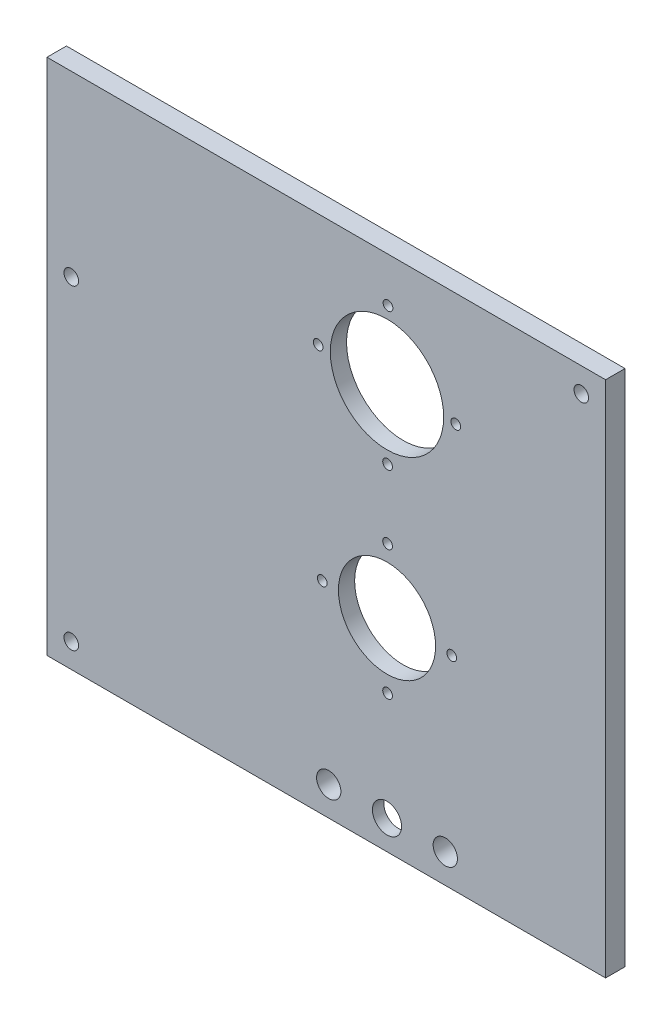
from build123d import *

# Parameters (mm, degrees)
ESQUISSE1_W             = 345
ESQUISSE1_H             = 320
ESQUISSE1_R             = 4.5
ESQUISSE1_R_2           = 30
ESQUISSE1_R_3           = 35
BASE_EXTRUSION_DEPTH    = 12
ESQUISSE2_R             = 55
ESQUISSE2_R_2           = 47.5
ENL_V_MAT_EXTRU_1_DEPTH = 2
PER_AGE3_D              = 6
ESQUISSE8_R             = 9
ESQUISSE8_R_2           = 7.5
ENL_V_MAT_EXTRU_2_DEPTH = 348.230471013
ENL_V_MAT_EXTRU_3_DEPTH = 5


with BuildPart() as part:
    # Esquisse1 → Base-Extrusion (new body)
    with BuildSketch(Plane.XY):
        with Locations((32.5, -120)):
            Rectangle(ESQUISSE1_W, ESQUISSE1_H)
        with Locations((190, 25)):
            Circle(ESQUISSE1_R, mode=Mode.SUBTRACT)
        with Locations((-125, -265)):
            Circle(ESQUISSE1_R, mode=Mode.SUBTRACT)
        with Locations(Location((70, -155, 0), (0, 0, 180))):
            Circle(ESQUISSE1_R_2, mode=Mode.SUBTRACT)
        with Locations(Location((70, -30, 0), (0, 0, 180))):
            Circle(ESQUISSE1_R_3, mode=Mode.SUBTRACT)
        with Locations((-125, -70)):
            Circle(ESQUISSE1_R, mode=Mode.SUBTRACT)
    extrude(amount=BASE_EXTRUSION_DEPTH)

    # Esquisse2 → Enl_v. mat.-Extru.1 (cut)
    with BuildSketch(Plane(origin=(0, 0, 0), x_dir=(-1, 0, 0), z_dir=(0, 0, -1))):
        with Locations((-70, -30)):
            Circle(ESQUISSE2_R)
        with Locations((-70, -155)):
            Circle(ESQUISSE2_R_2)
    extrude(amount=-ENL_V_MAT_EXTRU_1_DEPTH, mode=Mode.SUBTRACT)

    # Per_age3 (through all)
    with Locations(Plane.XY.offset(12)):
        with Locations((70.60973448, 12.5), (70.358898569, -72.5), (112.5, -30), (27.5, -30), (110, -155), (70.358898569, -195), (30, -155), (70.358898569, -115)):
            Hole(PER_AGE3_D / 2)

    # Esquisse8 → Enl_v. mat.-Extru.2 (cut, through all)
    with BuildSketch(Plane.XY.offset(12)):
        with Locations((70, -262)):
            Circle(ESQUISSE8_R)
        with Locations((34, -262)):
            Circle(ESQUISSE8_R_2)
        with Locations((106, -262)):
            Circle(ESQUISSE8_R_2)
    extrude(amount=-ENL_V_MAT_EXTRU_2_DEPTH, mode=Mode.SUBTRACT)

    # Esquisse9 → Enl_v. mat.-Extru.3 (cut)
    with BuildSketch(Plane(origin=(0, 0, 0), x_dir=(-1, 0, 0), z_dir=(0, 0, -1))):
        with BuildLine():
            Line((-52, -262), (-52, -280))
            Line((-52, -280), (-88, -280))
            Line((-88, -280), (-88, -262))
            ThreePointArc((-88, -262), (-70, -244), (-52, -262))
        make_face()
    extrude(amount=-ENL_V_MAT_EXTRU_3_DEPTH, mode=Mode.SUBTRACT)


solid = part.part
